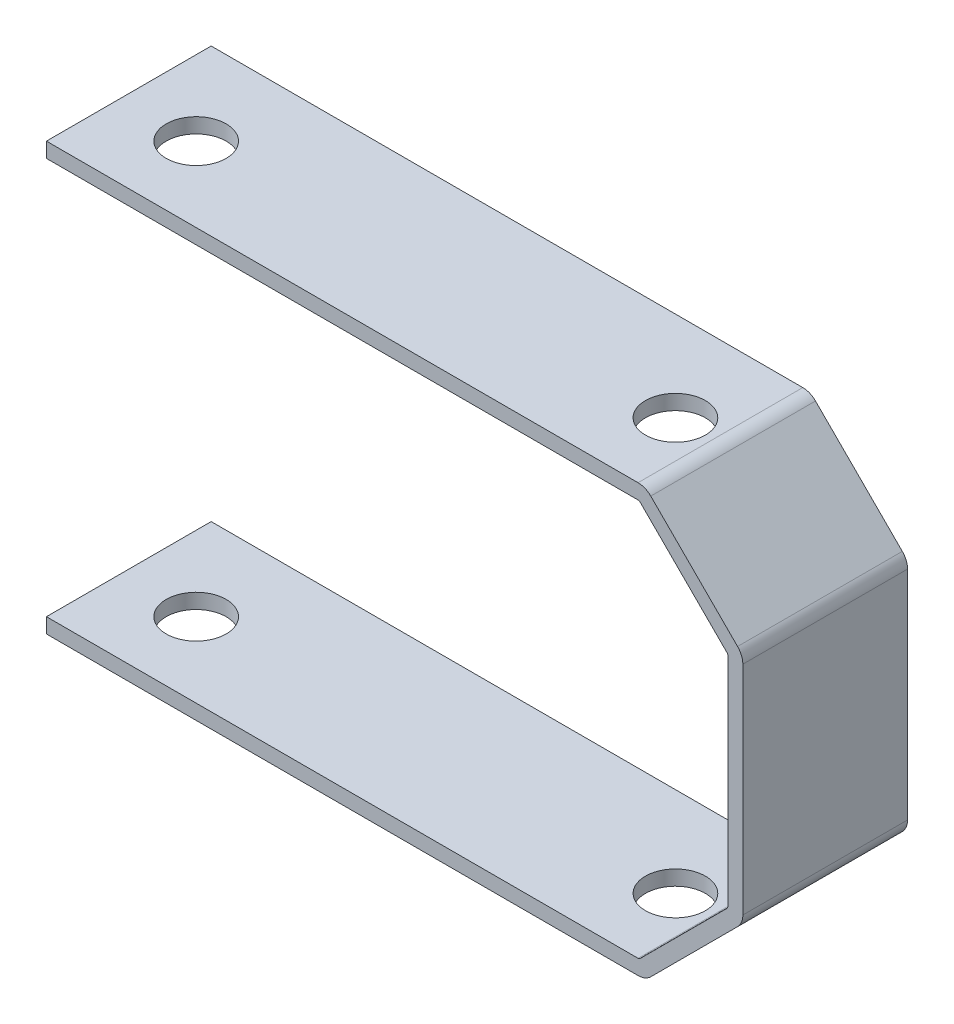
ISO-10303-21;
HEADER;
FILE_DESCRIPTION(('STEP AP214'),'2;1');
FILE_NAME('part.step','',(''),(''),'','','');
FILE_SCHEMA(('AUTOMOTIVE_DESIGN { 1 0 10303 214 1 1 1 1 }'));
ENDSEC;
DATA;
#1=APPLICATION_CONTEXT('core data for automotive mechanical design processes');
#2=APPLICATION_PROTOCOL_DEFINITION('international standard','automotive_design',2000,#1);
#3=PRODUCT_CONTEXT('',#1,'mechanical');
#4=PRODUCT('Part','Part','',(#3));
#5=PRODUCT_RELATED_PRODUCT_CATEGORY('part','',(#4));
#6=PRODUCT_DEFINITION_FORMATION('','',#4);
#7=PRODUCT_DEFINITION_CONTEXT('part definition',#1,'design');
#8=PRODUCT_DEFINITION('design','',#6,#7);
#9=PRODUCT_DEFINITION_SHAPE('','',#8);
#10=(LENGTH_UNIT() NAMED_UNIT(*) SI_UNIT(.MILLI.,.METRE.));
#11=(NAMED_UNIT(*) PLANE_ANGLE_UNIT() SI_UNIT($,.RADIAN.));
#12=(NAMED_UNIT(*) SI_UNIT($,.STERADIAN.) SOLID_ANGLE_UNIT());
#13=UNCERTAINTY_MEASURE_WITH_UNIT(LENGTH_MEASURE(1.E-05),#10,'distance_accuracy_value','');
#14=(GEOMETRIC_REPRESENTATION_CONTEXT(3) GLOBAL_UNCERTAINTY_ASSIGNED_CONTEXT((#13)) GLOBAL_UNIT_ASSIGNED_CONTEXT((#10,
#11,#12)) REPRESENTATION_CONTEXT('',''));
#15=CARTESIAN_POINT('',(0.,0.,0.));
#16=DIRECTION('',(0.,0.,1.));
#17=DIRECTION('',(1.,0.,0.));
#18=AXIS2_PLACEMENT_3D('',#15,#16,#17);
#19=CARTESIAN_POINT('',(875.126946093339,307.774921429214,0.));
#20=DIRECTION('',(0.,0.,1.));
#21=DIRECTION('',(1.,0.,0.));
#22=AXIS2_PLACEMENT_3D('',#19,#20,#21);
#23=CYLINDRICAL_SURFACE('',#22,2.);
#24=DIRECTION('',(0.,0.,1.));
#25=VECTOR('',#24,1.);
#26=CARTESIAN_POINT('',(876.541159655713,309.189134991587,0.));
#27=LINE('',#26,#25);
#28=CARTESIAN_POINT('',(876.541159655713,309.189134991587,0.));
#29=VERTEX_POINT('',#28);
#30=CARTESIAN_POINT('',(876.541159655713,309.189134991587,110.));
#31=VERTEX_POINT('',#30);
#32=EDGE_CURVE('E151',#29,#31,#27,.T.);
#33=ORIENTED_EDGE('',*,*,#32,.F.);
#34=CARTESIAN_POINT('',(875.126946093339,307.774921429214,0.));
#35=DIRECTION('',(0.,0.,1.));
#36=DIRECTION('',(1.,0.,0.));
#37=AXIS2_PLACEMENT_3D('',#34,#35,#36);
#38=CIRCLE('',#37,2.);
#39=CARTESIAN_POINT('',(877.126946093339,307.774921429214,0.));
#40=VERTEX_POINT('',#39);
#41=EDGE_CURVE('E20',#40,#29,#38,.T.);
#42=ORIENTED_EDGE('',*,*,#41,.F.);
#43=DIRECTION('',(0.,0.,1.));
#44=VECTOR('',#43,1.);
#45=CARTESIAN_POINT('',(877.126946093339,307.774921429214,0.));
#46=LINE('',#45,#44);
#47=CARTESIAN_POINT('',(877.126946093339,307.774921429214,110.));
#48=VERTEX_POINT('',#47);
#49=EDGE_CURVE('E155',#48,#40,#46,.F.);
#50=ORIENTED_EDGE('',*,*,#49,.F.);
#51=CARTESIAN_POINT('',(875.126946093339,307.774921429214,110.));
#52=DIRECTION('',(0.,0.,1.));
#53=DIRECTION('',(1.,0.,0.));
#54=AXIS2_PLACEMENT_3D('',#51,#52,#53);
#55=CIRCLE('',#54,2.);
#56=EDGE_CURVE('E149',#31,#48,#55,.F.);
#57=ORIENTED_EDGE('',*,*,#56,.F.);
#58=EDGE_LOOP('',(#33,#42,#50,#57));
#59=FACE_BOUND('',#58,.T.);
#60=ADVANCED_FACE('F16',(#59),#23,.F.);
#61=CARTESIAN_POINT('',(875.126946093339,162.716046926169,0.));
#62=DIRECTION('',(0.,0.,1.));
#63=DIRECTION('',(1.,0.,0.));
#64=AXIS2_PLACEMENT_3D('',#61,#62,#63);
#65=CYLINDRICAL_SURFACE('',#64,2.);
#66=DIRECTION('',(0.,0.,1.));
#67=VECTOR('',#66,1.);
#68=CARTESIAN_POINT('',(877.126946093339,162.716046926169,0.));
#69=LINE('',#68,#67);
#70=CARTESIAN_POINT('',(877.126946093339,162.716046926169,0.));
#71=VERTEX_POINT('',#70);
#72=CARTESIAN_POINT('',(877.126946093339,162.716046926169,110.));
#73=VERTEX_POINT('',#72);
#74=EDGE_CURVE('E255',#71,#73,#69,.T.);
#75=ORIENTED_EDGE('',*,*,#74,.F.);
#76=CARTESIAN_POINT('',(875.126946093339,162.716046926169,0.));
#77=DIRECTION('',(0.,0.,1.));
#78=DIRECTION('',(1.,0.,0.));
#79=AXIS2_PLACEMENT_3D('',#76,#77,#78);
#80=CIRCLE('',#79,2.);
#81=CARTESIAN_POINT('',(876.541159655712,161.301833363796,0.));
#82=VERTEX_POINT('',#81);
#83=EDGE_CURVE('E315',#82,#71,#80,.T.);
#84=ORIENTED_EDGE('',*,*,#83,.F.);
#85=DIRECTION('',(0.,0.,1.));
#86=VECTOR('',#85,1.);
#87=CARTESIAN_POINT('',(876.541159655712,161.301833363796,0.));
#88=LINE('',#87,#86);
#89=CARTESIAN_POINT('',(876.541159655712,161.301833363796,110.));
#90=VERTEX_POINT('',#89);
#91=EDGE_CURVE('E252',#90,#82,#88,.F.);
#92=ORIENTED_EDGE('',*,*,#91,.F.);
#93=CARTESIAN_POINT('',(875.126946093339,162.716046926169,110.));
#94=DIRECTION('',(0.,0.,1.));
#95=DIRECTION('',(1.,0.,0.));
#96=AXIS2_PLACEMENT_3D('',#93,#94,#95);
#97=CIRCLE('',#96,2.);
#98=EDGE_CURVE('E313',#73,#90,#97,.F.);
#99=ORIENTED_EDGE('',*,*,#98,.F.);
#100=EDGE_LOOP('',(#75,#84,#92,#99));
#101=FACE_BOUND('',#100,.T.);
#102=ADVANCED_FACE('F369',(#101),#65,.F.);
#103=CARTESIAN_POINT('',(817.156383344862,365.745484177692,0.));
#104=DIRECTION('',(0.,0.,1.));
#105=DIRECTION('',(1.,0.,0.));
#106=AXIS2_PLACEMENT_3D('',#103,#104,#105);
#107=CYLINDRICAL_SURFACE('',#106,2.);
#108=DIRECTION('',(0.,0.,-1.));
#109=VECTOR('',#108,1.);
#110=CARTESIAN_POINT('',(817.156383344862,367.745484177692,0.));
#111=LINE('',#110,#109);
#112=CARTESIAN_POINT('',(817.156383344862,367.745484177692,0.));
#113=VERTEX_POINT('',#112);
#114=CARTESIAN_POINT('',(817.156383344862,367.745484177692,110.));
#115=VERTEX_POINT('',#114);
#116=EDGE_CURVE('E204',#113,#115,#111,.F.);
#117=ORIENTED_EDGE('',*,*,#116,.F.);
#118=CARTESIAN_POINT('',(817.156383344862,365.745484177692,0.));
#119=DIRECTION('',(0.,0.,1.));
#120=DIRECTION('',(1.,0.,0.));
#121=AXIS2_PLACEMENT_3D('',#118,#119,#120);
#122=CIRCLE('',#121,2.);
#123=CARTESIAN_POINT('',(818.570596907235,367.159697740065,0.));
#124=VERTEX_POINT('',#123);
#125=EDGE_CURVE('E311',#124,#113,#122,.T.);
#126=ORIENTED_EDGE('',*,*,#125,.F.);
#127=DIRECTION('',(0.,0.,1.));
#128=VECTOR('',#127,1.);
#129=CARTESIAN_POINT('',(818.570596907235,367.159697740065,0.));
#130=LINE('',#129,#128);
#131=CARTESIAN_POINT('',(818.570596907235,367.159697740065,110.));
#132=VERTEX_POINT('',#131);
#133=EDGE_CURVE('E156',#132,#124,#130,.F.);
#134=ORIENTED_EDGE('',*,*,#133,.F.);
#135=CARTESIAN_POINT('',(817.156383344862,365.745484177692,110.));
#136=DIRECTION('',(0.,0.,1.));
#137=DIRECTION('',(1.,0.,0.));
#138=AXIS2_PLACEMENT_3D('',#135,#136,#137);
#139=CIRCLE('',#138,2.);
#140=EDGE_CURVE('E309',#115,#132,#139,.F.);
#141=ORIENTED_EDGE('',*,*,#140,.F.);
#142=EDGE_LOOP('',(#117,#126,#134,#141));
#143=FACE_BOUND('',#142,.T.);
#144=ADVANCED_FACE('F371',(#143),#107,.F.);
#145=CARTESIAN_POINT('',(472.12694609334,367.745484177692,60.));
#146=DIRECTION('',(0.,1.,0.));
#147=DIRECTION('',(0.,0.,1.));
#148=AXIS2_PLACEMENT_3D('',#145,#146,#147);
#149=CYLINDRICAL_SURFACE('',#148,20.);
#150=CARTESIAN_POINT('',(472.12694609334,377.745484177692,60.));
#151=DIRECTION('',(0.,1.,0.));
#152=DIRECTION('',(0.,0.,1.));
#153=AXIS2_PLACEMENT_3D('',#150,#151,#152);
#154=CIRCLE('',#153,20.);
#155=CARTESIAN_POINT('',(472.12694609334,377.745484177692,80.));
#156=VERTEX_POINT('',#155);
#157=EDGE_CURVE('E229',#156,#156,#154,.F.);
#158=ORIENTED_EDGE('',*,*,#157,.F.);
#159=EDGE_LOOP('',(#158));
#160=FACE_BOUND('',#159,.T.);
#161=CARTESIAN_POINT('',(472.12694609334,367.745484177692,60.));
#162=DIRECTION('',(0.,1.,0.));
#163=DIRECTION('',(0.,0.,1.));
#164=AXIS2_PLACEMENT_3D('',#161,#162,#163);
#165=CIRCLE('',#164,20.);
#166=CARTESIAN_POINT('',(472.12694609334,367.745484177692,80.));
#167=VERTEX_POINT('',#166);
#168=EDGE_CURVE('E207',#167,#167,#165,.T.);
#169=ORIENTED_EDGE('',*,*,#168,.F.);
#170=EDGE_LOOP('',(#169));
#171=FACE_BOUND('',#170,.T.);
#172=ADVANCED_FACE('F376',(#160,#171),#149,.F.);
#173=CARTESIAN_POINT('',(792.12694609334,367.745484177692,60.0000000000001));
#174=DIRECTION('',(0.,1.,0.));
#175=DIRECTION('',(0.,0.,1.));
#176=AXIS2_PLACEMENT_3D('',#173,#174,#175);
#177=CYLINDRICAL_SURFACE('',#176,20.);
#178=CARTESIAN_POINT('',(792.12694609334,377.745484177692,60.0000000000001));
#179=DIRECTION('',(0.,1.,0.));
#180=DIRECTION('',(0.,0.,1.));
#181=AXIS2_PLACEMENT_3D('',#178,#179,#180);
#182=CIRCLE('',#181,20.);
#183=CARTESIAN_POINT('',(792.12694609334,377.745484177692,80.0000000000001));
#184=VERTEX_POINT('',#183);
#185=EDGE_CURVE('E223',#184,#184,#182,.F.);
#186=ORIENTED_EDGE('',*,*,#185,.F.);
#187=EDGE_LOOP('',(#186));
#188=FACE_BOUND('',#187,.T.);
#189=CARTESIAN_POINT('',(792.12694609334,367.745484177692,60.0000000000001));
#190=DIRECTION('',(0.,1.,0.));
#191=DIRECTION('',(0.,0.,1.));
#192=AXIS2_PLACEMENT_3D('',#189,#190,#191);
#193=CIRCLE('',#192,20.);
#194=CARTESIAN_POINT('',(792.12694609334,367.745484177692,80.0000000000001));
#195=VERTEX_POINT('',#194);
#196=EDGE_CURVE('E245',#195,#195,#193,.T.);
#197=ORIENTED_EDGE('',*,*,#196,.F.);
#198=EDGE_LOOP('',(#197));
#199=FACE_BOUND('',#198,.T.);
#200=ADVANCED_FACE('F396',(#188,#199),#177,.F.);
#201=CARTESIAN_POINT('',(817.156383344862,104.745484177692,0.));
#202=DIRECTION('',(0.,0.,1.));
#203=DIRECTION('',(1.,0.,0.));
#204=AXIS2_PLACEMENT_3D('',#201,#202,#203);
#205=CYLINDRICAL_SURFACE('',#204,2.);
#206=DIRECTION('',(0.,0.,1.));
#207=VECTOR('',#206,1.);
#208=CARTESIAN_POINT('',(818.570596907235,103.331270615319,0.));
#209=LINE('',#208,#207);
#210=CARTESIAN_POINT('',(818.570596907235,103.331270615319,0.));
#211=VERTEX_POINT('',#210);
#212=CARTESIAN_POINT('',(818.570596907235,103.331270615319,110.));
#213=VERTEX_POINT('',#212);
#214=EDGE_CURVE('E242',#211,#213,#209,.T.);
#215=ORIENTED_EDGE('',*,*,#214,.F.);
#216=CARTESIAN_POINT('',(817.156383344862,104.745484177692,0.));
#217=DIRECTION('',(0.,0.,1.));
#218=DIRECTION('',(1.,0.,0.));
#219=AXIS2_PLACEMENT_3D('',#216,#217,#218);
#220=CIRCLE('',#219,2.);
#221=CARTESIAN_POINT('',(817.156383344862,102.745484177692,0.));
#222=VERTEX_POINT('',#221);
#223=EDGE_CURVE('E307',#222,#211,#220,.T.);
#224=ORIENTED_EDGE('',*,*,#223,.F.);
#225=DIRECTION('',(0.,0.,1.));
#226=VECTOR('',#225,1.);
#227=CARTESIAN_POINT('',(817.156383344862,102.745484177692,0.));
#228=LINE('',#227,#226);
#229=CARTESIAN_POINT('',(817.156383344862,102.745484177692,110.));
#230=VERTEX_POINT('',#229);
#231=EDGE_CURVE('E244',#230,#222,#228,.F.);
#232=ORIENTED_EDGE('',*,*,#231,.F.);
#233=CARTESIAN_POINT('',(817.156383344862,104.745484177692,110.));
#234=DIRECTION('',(0.,0.,1.));
#235=DIRECTION('',(1.,0.,0.));
#236=AXIS2_PLACEMENT_3D('',#233,#234,#235);
#237=CIRCLE('',#236,2.);
#238=EDGE_CURVE('E261',#213,#230,#237,.F.);
#239=ORIENTED_EDGE('',*,*,#238,.F.);
#240=EDGE_LOOP('',(#215,#224,#232,#239));
#241=FACE_BOUND('',#240,.T.);
#242=ADVANCED_FACE('F363',(#241),#205,.F.);
#243=CARTESIAN_POINT('',(876.541159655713,309.189134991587,0.));
#244=DIRECTION('',(-0.707106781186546,-0.707106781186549,0.));
#245=DIRECTION('',(0.707106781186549,-0.707106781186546,0.));
#246=AXIS2_PLACEMENT_3D('',#243,#244,#245);
#247=PLANE('',#246);
#248=DIRECTION('',(0.707106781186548,-0.707106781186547,0.));
#249=VECTOR('',#248,1.);
#250=CARTESIAN_POINT('',(818.570596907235,367.159697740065,0.));
#251=LINE('',#250,#249);
#252=EDGE_CURVE('E146',#124,#29,#251,.T.);
#253=ORIENTED_EDGE('',*,*,#252,.T.);
#254=ORIENTED_EDGE('',*,*,#32,.T.);
#255=DIRECTION('',(0.707106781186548,-0.707106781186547,0.));
#256=VECTOR('',#255,1.);
#257=CARTESIAN_POINT('',(818.570596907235,367.159697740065,110.));
#258=LINE('',#257,#256);
#259=EDGE_CURVE('E321',#132,#31,#258,.T.);
#260=ORIENTED_EDGE('',*,*,#259,.F.);
#261=ORIENTED_EDGE('',*,*,#133,.T.);
#262=EDGE_LOOP('',(#253,#254,#260,#261));
#263=FACE_BOUND('',#262,.T.);
#264=ADVANCED_FACE('F159',(#263),#247,.T.);
#265=CARTESIAN_POINT('',(877.126946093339,162.716046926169,0.));
#266=DIRECTION('',(-1.,0.,0.));
#267=DIRECTION('',(0.,0.,1.));
#268=AXIS2_PLACEMENT_3D('',#265,#266,#267);
#269=PLANE('',#268);
#270=DIRECTION('',(0.,1.,0.));
#271=VECTOR('',#270,1.);
#272=CARTESIAN_POINT('',(877.126946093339,235.245484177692,0.));
#273=LINE('',#272,#271);
#274=EDGE_CURVE('E148',#40,#71,#273,.F.);
#275=ORIENTED_EDGE('',*,*,#274,.T.);
#276=ORIENTED_EDGE('',*,*,#74,.T.);
#277=DIRECTION('',(0.,1.,0.));
#278=VECTOR('',#277,1.);
#279=CARTESIAN_POINT('',(877.126946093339,235.245484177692,110.));
#280=LINE('',#279,#278);
#281=EDGE_CURVE('E320',#48,#73,#280,.F.);
#282=ORIENTED_EDGE('',*,*,#281,.F.);
#283=ORIENTED_EDGE('',*,*,#49,.T.);
#284=EDGE_LOOP('',(#275,#276,#282,#283));
#285=FACE_BOUND('',#284,.T.);
#286=ADVANCED_FACE('F323',(#285),#269,.T.);
#287=CARTESIAN_POINT('',(818.570596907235,103.331270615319,0.));
#288=DIRECTION('',(-0.707106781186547,0.707106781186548,0.));
#289=DIRECTION('',(-0.707106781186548,-0.707106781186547,0.));
#290=AXIS2_PLACEMENT_3D('',#287,#288,#289);
#291=PLANE('',#290);
#292=DIRECTION('',(-0.707106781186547,-0.707106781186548,0.));
#293=VECTOR('',#292,1.);
#294=CARTESIAN_POINT('',(876.541159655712,161.301833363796,0.));
#295=LINE('',#294,#293);
#296=EDGE_CURVE('E163',#82,#211,#295,.T.);
#297=ORIENTED_EDGE('',*,*,#296,.T.);
#298=ORIENTED_EDGE('',*,*,#214,.T.);
#299=DIRECTION('',(-0.707106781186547,-0.707106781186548,0.));
#300=VECTOR('',#299,1.);
#301=CARTESIAN_POINT('',(876.541159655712,161.301833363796,110.));
#302=LINE('',#301,#300);
#303=EDGE_CURVE('E325',#90,#213,#302,.T.);
#304=ORIENTED_EDGE('',*,*,#303,.F.);
#305=ORIENTED_EDGE('',*,*,#91,.T.);
#306=EDGE_LOOP('',(#297,#298,#304,#305));
#307=FACE_BOUND('',#306,.T.);
#308=ADVANCED_FACE('F355',(#307),#291,.T.);
#309=CARTESIAN_POINT('',(875.126946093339,162.716046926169,0.));
#310=DIRECTION('',(0.,0.,1.));
#311=DIRECTION('',(1.,0.,0.));
#312=AXIS2_PLACEMENT_3D('',#309,#310,#311);
#313=CYLINDRICAL_SURFACE('',#312,12.);
#314=CARTESIAN_POINT('',(875.126946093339,162.716046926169,0.));
#315=DIRECTION('',(0.,0.,1.));
#316=DIRECTION('',(1.,0.,0.));
#317=AXIS2_PLACEMENT_3D('',#314,#315,#316);
#318=CIRCLE('',#317,12.);
#319=CARTESIAN_POINT('',(883.612227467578,154.23076555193,0.));
#320=VERTEX_POINT('',#319);
#321=CARTESIAN_POINT('',(887.126946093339,162.716046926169,0.));
#322=VERTEX_POINT('',#321);
#323=EDGE_CURVE('E284',#320,#322,#318,.T.);
#324=ORIENTED_EDGE('',*,*,#323,.T.);
#325=DIRECTION('',(0.,0.,-1.));
#326=VECTOR('',#325,1.);
#327=CARTESIAN_POINT('',(887.126946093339,162.716046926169,0.));
#328=LINE('',#327,#326);
#329=CARTESIAN_POINT('',(887.126946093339,162.716046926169,110.));
#330=VERTEX_POINT('',#329);
#331=EDGE_CURVE('E239',#330,#322,#328,.T.);
#332=ORIENTED_EDGE('',*,*,#331,.F.);
#333=CARTESIAN_POINT('',(875.126946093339,162.716046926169,110.));
#334=DIRECTION('',(0.,0.,1.));
#335=DIRECTION('',(1.,0.,0.));
#336=AXIS2_PLACEMENT_3D('',#333,#334,#335);
#337=CIRCLE('',#336,12.);
#338=CARTESIAN_POINT('',(883.612227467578,154.23076555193,110.));
#339=VERTEX_POINT('',#338);
#340=EDGE_CURVE('E294',#339,#330,#337,.T.);
#341=ORIENTED_EDGE('',*,*,#340,.F.);
#342=DIRECTION('',(0.,0.,1.));
#343=VECTOR('',#342,1.);
#344=CARTESIAN_POINT('',(883.612227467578,154.23076555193,0.));
#345=LINE('',#344,#343);
#346=EDGE_CURVE('E243',#320,#339,#345,.T.);
#347=ORIENTED_EDGE('',*,*,#346,.F.);
#348=EDGE_LOOP('',(#324,#332,#341,#347));
#349=FACE_BOUND('',#348,.T.);
#350=ADVANCED_FACE('F458',(#349),#313,.T.);
#351=CARTESIAN_POINT('',(887.126946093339,307.774921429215,0.));
#352=DIRECTION('',(1.,0.,0.));
#353=DIRECTION('',(0.,0.,-1.));
#354=AXIS2_PLACEMENT_3D('',#351,#352,#353);
#355=PLANE('',#354);
#356=DIRECTION('',(0.,1.,0.));
#357=VECTOR('',#356,1.);
#358=CARTESIAN_POINT('',(887.126946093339,235.245484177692,0.));
#359=LINE('',#358,#357);
#360=CARTESIAN_POINT('',(887.126946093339,307.774921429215,0.));
#361=VERTEX_POINT('',#360);
#362=EDGE_CURVE('E283',#322,#361,#359,.T.);
#363=ORIENTED_EDGE('',*,*,#362,.T.);
#364=DIRECTION('',(0.,0.,1.));
#365=VECTOR('',#364,1.);
#366=CARTESIAN_POINT('',(887.126946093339,307.774921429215,0.));
#367=LINE('',#366,#365);
#368=CARTESIAN_POINT('',(887.126946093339,307.774921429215,110.));
#369=VERTEX_POINT('',#368);
#370=EDGE_CURVE('E236',#369,#361,#367,.F.);
#371=ORIENTED_EDGE('',*,*,#370,.F.);
#372=DIRECTION('',(0.,1.,0.));
#373=VECTOR('',#372,1.);
#374=CARTESIAN_POINT('',(887.126946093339,235.245484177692,110.));
#375=LINE('',#374,#373);
#376=EDGE_CURVE('E293',#330,#369,#375,.T.);
#377=ORIENTED_EDGE('',*,*,#376,.F.);
#378=ORIENTED_EDGE('',*,*,#331,.T.);
#379=EDGE_LOOP('',(#363,#371,#377,#378));
#380=FACE_BOUND('',#379,.T.);
#381=ADVANCED_FACE('F462',(#380),#355,.T.);
#382=CARTESIAN_POINT('',(875.126946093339,307.774921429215,0.));
#383=DIRECTION('',(0.,0.,1.));
#384=DIRECTION('',(1.,0.,0.));
#385=AXIS2_PLACEMENT_3D('',#382,#383,#384);
#386=CYLINDRICAL_SURFACE('',#385,12.);
#387=CARTESIAN_POINT('',(875.126946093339,307.774921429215,0.));
#388=DIRECTION('',(0.,0.,1.));
#389=DIRECTION('',(1.,0.,0.));
#390=AXIS2_PLACEMENT_3D('',#387,#388,#389);
#391=CIRCLE('',#390,12.);
#392=CARTESIAN_POINT('',(883.612227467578,316.260202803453,0.));
#393=VERTEX_POINT('',#392);
#394=EDGE_CURVE('E281',#361,#393,#391,.T.);
#395=ORIENTED_EDGE('',*,*,#394,.T.);
#396=DIRECTION('',(0.,0.,1.));
#397=VECTOR('',#396,1.);
#398=CARTESIAN_POINT('',(883.612227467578,316.260202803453,0.));
#399=LINE('',#398,#397);
#400=CARTESIAN_POINT('',(883.612227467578,316.260202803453,110.));
#401=VERTEX_POINT('',#400);
#402=EDGE_CURVE('E233',#401,#393,#399,.F.);
#403=ORIENTED_EDGE('',*,*,#402,.F.);
#404=CARTESIAN_POINT('',(875.126946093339,307.774921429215,110.));
#405=DIRECTION('',(0.,0.,1.));
#406=DIRECTION('',(1.,0.,0.));
#407=AXIS2_PLACEMENT_3D('',#404,#405,#406);
#408=CIRCLE('',#407,12.);
#409=EDGE_CURVE('E290',#369,#401,#408,.T.);
#410=ORIENTED_EDGE('',*,*,#409,.F.);
#411=ORIENTED_EDGE('',*,*,#370,.T.);
#412=EDGE_LOOP('',(#395,#403,#410,#411));
#413=FACE_BOUND('',#412,.T.);
#414=ADVANCED_FACE('F466',(#413),#386,.T.);
#415=CARTESIAN_POINT('',(825.641664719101,374.23076555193,0.));
#416=DIRECTION('',(0.707106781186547,0.707106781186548,0.));
#417=DIRECTION('',(-0.707106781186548,0.707106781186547,0.));
#418=AXIS2_PLACEMENT_3D('',#415,#416,#417);
#419=PLANE('',#418);
#420=DIRECTION('',(-0.707106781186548,0.707106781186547,0.));
#421=VECTOR('',#420,1.);
#422=CARTESIAN_POINT('',(883.612227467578,316.260202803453,0.));
#423=LINE('',#422,#421);
#424=CARTESIAN_POINT('',(825.641664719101,374.23076555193,0.));
#425=VERTEX_POINT('',#424);
#426=EDGE_CURVE('E280',#393,#425,#423,.T.);
#427=ORIENTED_EDGE('',*,*,#426,.T.);
#428=DIRECTION('',(0.,0.,1.));
#429=VECTOR('',#428,1.);
#430=CARTESIAN_POINT('',(825.641664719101,374.23076555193,0.));
#431=LINE('',#430,#429);
#432=CARTESIAN_POINT('',(825.641664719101,374.23076555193,110.));
#433=VERTEX_POINT('',#432);
#434=EDGE_CURVE('E230',#433,#425,#431,.F.);
#435=ORIENTED_EDGE('',*,*,#434,.F.);
#436=DIRECTION('',(-0.707106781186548,0.707106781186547,0.));
#437=VECTOR('',#436,1.);
#438=CARTESIAN_POINT('',(883.612227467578,316.260202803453,110.));
#439=LINE('',#438,#437);
#440=EDGE_CURVE('E289',#401,#433,#439,.T.);
#441=ORIENTED_EDGE('',*,*,#440,.F.);
#442=ORIENTED_EDGE('',*,*,#402,.T.);
#443=EDGE_LOOP('',(#427,#435,#441,#442));
#444=FACE_BOUND('',#443,.T.);
#445=ADVANCED_FACE('F470',(#444),#419,.T.);
#446=CARTESIAN_POINT('',(817.156383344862,365.745484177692,0.));
#447=DIRECTION('',(0.,0.,1.));
#448=DIRECTION('',(1.,0.,0.));
#449=AXIS2_PLACEMENT_3D('',#446,#447,#448);
#450=CYLINDRICAL_SURFACE('',#449,12.);
#451=CARTESIAN_POINT('',(817.156383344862,365.745484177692,0.));
#452=DIRECTION('',(0.,0.,1.));
#453=DIRECTION('',(1.,0.,0.));
#454=AXIS2_PLACEMENT_3D('',#451,#452,#453);
#455=CIRCLE('',#454,12.);
#456=CARTESIAN_POINT('',(817.156383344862,377.745484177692,0.));
#457=VERTEX_POINT('',#456);
#458=EDGE_CURVE('E278',#425,#457,#455,.T.);
#459=ORIENTED_EDGE('',*,*,#458,.T.);
#460=DIRECTION('',(0.,0.,1.));
#461=VECTOR('',#460,1.);
#462=CARTESIAN_POINT('',(817.156383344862,377.745484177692,0.));
#463=LINE('',#462,#461);
#464=CARTESIAN_POINT('',(817.156383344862,377.745484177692,110.));
#465=VERTEX_POINT('',#464);
#466=EDGE_CURVE('E226',#465,#457,#463,.F.);
#467=ORIENTED_EDGE('',*,*,#466,.F.);
#468=CARTESIAN_POINT('',(817.156383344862,365.745484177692,110.));
#469=DIRECTION('',(0.,0.,1.));
#470=DIRECTION('',(1.,0.,0.));
#471=AXIS2_PLACEMENT_3D('',#468,#469,#470);
#472=CIRCLE('',#471,12.);
#473=EDGE_CURVE('E286',#433,#465,#472,.T.);
#474=ORIENTED_EDGE('',*,*,#473,.F.);
#475=ORIENTED_EDGE('',*,*,#434,.T.);
#476=EDGE_LOOP('',(#459,#467,#474,#475));
#477=FACE_BOUND('',#476,.T.);
#478=ADVANCED_FACE('F472',(#477),#450,.T.);
#479=CARTESIAN_POINT('',(422.126946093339,377.745484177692,0.));
#480=DIRECTION('',(0.,1.,0.));
#481=DIRECTION('',(0.,0.,1.));
#482=AXIS2_PLACEMENT_3D('',#479,#480,#481);
#483=PLANE('',#482);
#484=ORIENTED_EDGE('',*,*,#185,.T.);
#485=EDGE_LOOP('',(#484));
#486=FACE_BOUND('',#485,.T.);
#487=ORIENTED_EDGE('',*,*,#157,.T.);
#488=EDGE_LOOP('',(#487));
#489=FACE_BOUND('',#488,.T.);
#490=DIRECTION('',(1.,0.,0.));
#491=VECTOR('',#490,1.);
#492=CARTESIAN_POINT('',(689.644730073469,377.745484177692,0.));
#493=LINE('',#492,#491);
#494=CARTESIAN_POINT('',(422.126946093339,377.745484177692,0.));
#495=VERTEX_POINT('',#494);
#496=EDGE_CURVE('E218',#457,#495,#493,.F.);
#497=ORIENTED_EDGE('',*,*,#496,.T.);
#498=DIRECTION('',(0.,0.,1.));
#499=VECTOR('',#498,1.);
#500=CARTESIAN_POINT('',(422.126946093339,377.745484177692,0.));
#501=LINE('',#500,#499);
#502=CARTESIAN_POINT('',(422.126946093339,377.745484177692,110.));
#503=VERTEX_POINT('',#502);
#504=EDGE_CURVE('E211',#503,#495,#501,.F.);
#505=ORIENTED_EDGE('',*,*,#504,.F.);
#506=DIRECTION('',(1.,0.,0.));
#507=VECTOR('',#506,1.);
#508=CARTESIAN_POINT('',(689.644730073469,377.745484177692,110.));
#509=LINE('',#508,#507);
#510=EDGE_CURVE('E192',#465,#503,#509,.F.);
#511=ORIENTED_EDGE('',*,*,#510,.F.);
#512=ORIENTED_EDGE('',*,*,#466,.T.);
#513=EDGE_LOOP('',(#497,#505,#511,#512));
#514=FACE_BOUND('',#513,.T.);
#515=ADVANCED_FACE('F428',(#486,#489,#514),#483,.T.);
#516=CARTESIAN_POINT('',(422.126946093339,367.745484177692,0.));
#517=DIRECTION('',(-1.,0.,0.));
#518=DIRECTION('',(0.,0.,1.));
#519=AXIS2_PLACEMENT_3D('',#516,#517,#518);
#520=PLANE('',#519);
#521=DIRECTION('',(0.,1.,0.));
#522=VECTOR('',#521,1.);
#523=CARTESIAN_POINT('',(422.126946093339,235.245484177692,0.));
#524=LINE('',#523,#522);
#525=CARTESIAN_POINT('',(422.126946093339,367.745484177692,0.));
#526=VERTEX_POINT('',#525);
#527=EDGE_CURVE('E214',#495,#526,#524,.F.);
#528=ORIENTED_EDGE('',*,*,#527,.T.);
#529=DIRECTION('',(0.,0.,-1.));
#530=VECTOR('',#529,1.);
#531=CARTESIAN_POINT('',(422.126946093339,367.745484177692,0.));
#532=LINE('',#531,#530);
#533=CARTESIAN_POINT('',(422.126946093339,367.745484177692,110.));
#534=VERTEX_POINT('',#533);
#535=EDGE_CURVE('E208',#534,#526,#532,.T.);
#536=ORIENTED_EDGE('',*,*,#535,.F.);
#537=DIRECTION('',(0.,1.,0.));
#538=VECTOR('',#537,1.);
#539=CARTESIAN_POINT('',(422.126946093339,235.245484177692,110.));
#540=LINE('',#539,#538);
#541=EDGE_CURVE('E251',#503,#534,#540,.F.);
#542=ORIENTED_EDGE('',*,*,#541,.F.);
#543=ORIENTED_EDGE('',*,*,#504,.T.);
#544=EDGE_LOOP('',(#528,#536,#542,#543));
#545=FACE_BOUND('',#544,.T.);
#546=ADVANCED_FACE('F433',(#545),#520,.T.);
#547=CARTESIAN_POINT('',(817.156383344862,367.745484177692,0.));
#548=DIRECTION('',(0.,-1.,0.));
#549=DIRECTION('',(0.,0.,-1.));
#550=AXIS2_PLACEMENT_3D('',#547,#548,#549);
#551=PLANE('',#550);
#552=ORIENTED_EDGE('',*,*,#196,.T.);
#553=EDGE_LOOP('',(#552));
#554=FACE_BOUND('',#553,.T.);
#555=ORIENTED_EDGE('',*,*,#168,.T.);
#556=EDGE_LOOP('',(#555));
#557=FACE_BOUND('',#556,.T.);
#558=DIRECTION('',(1.,0.,0.));
#559=VECTOR('',#558,1.);
#560=CARTESIAN_POINT('',(689.644730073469,367.745484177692,0.));
#561=LINE('',#560,#559);
#562=EDGE_CURVE('E217',#526,#113,#561,.T.);
#563=ORIENTED_EDGE('',*,*,#562,.T.);
#564=ORIENTED_EDGE('',*,*,#116,.T.);
#565=DIRECTION('',(1.,0.,0.));
#566=VECTOR('',#565,1.);
#567=CARTESIAN_POINT('',(689.644730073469,367.745484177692,110.));
#568=LINE('',#567,#566);
#569=EDGE_CURVE('E265',#534,#115,#568,.T.);
#570=ORIENTED_EDGE('',*,*,#569,.F.);
#571=ORIENTED_EDGE('',*,*,#535,.T.);
#572=EDGE_LOOP('',(#563,#564,#570,#571));
#573=FACE_BOUND('',#572,.T.);
#574=ADVANCED_FACE('F438',(#554,#557,#573),#551,.T.);
#575=CARTESIAN_POINT('',(883.612227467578,154.23076555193,0.));
#576=DIRECTION('',(0.707106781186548,-0.707106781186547,0.));
#577=DIRECTION('',(0.707106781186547,0.707106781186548,0.));
#578=AXIS2_PLACEMENT_3D('',#575,#576,#577);
#579=PLANE('',#578);
#580=DIRECTION('',(0.707106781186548,0.707106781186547,0.));
#581=VECTOR('',#580,1.);
#582=CARTESIAN_POINT('',(825.641664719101,96.2602028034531,0.));
#583=LINE('',#582,#581);
#584=CARTESIAN_POINT('',(825.641664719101,96.2602028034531,0.));
#585=VERTEX_POINT('',#584);
#586=EDGE_CURVE('E181',#585,#320,#583,.T.);
#587=ORIENTED_EDGE('',*,*,#586,.T.);
#588=ORIENTED_EDGE('',*,*,#346,.T.);
#589=DIRECTION('',(0.707106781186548,0.707106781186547,0.));
#590=VECTOR('',#589,1.);
#591=CARTESIAN_POINT('',(825.641664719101,96.2602028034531,110.));
#592=LINE('',#591,#590);
#593=CARTESIAN_POINT('',(825.641664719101,96.2602028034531,110.));
#594=VERTEX_POINT('',#593);
#595=EDGE_CURVE('E297',#594,#339,#592,.T.);
#596=ORIENTED_EDGE('',*,*,#595,.F.);
#597=DIRECTION('',(0.,0.,1.));
#598=VECTOR('',#597,1.);
#599=CARTESIAN_POINT('',(825.641664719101,96.2602028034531,0.));
#600=LINE('',#599,#598);
#601=EDGE_CURVE('E200',#585,#594,#600,.T.);
#602=ORIENTED_EDGE('',*,*,#601,.F.);
#603=EDGE_LOOP('',(#587,#588,#596,#602));
#604=FACE_BOUND('',#603,.T.);
#605=ADVANCED_FACE('F412',(#604),#579,.T.);
#606=CARTESIAN_POINT('',(422.12694609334,102.745484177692,0.));
#607=DIRECTION('',(0.,1.,0.));
#608=DIRECTION('',(0.,0.,1.));
#609=AXIS2_PLACEMENT_3D('',#606,#607,#608);
#610=PLANE('',#609);
#611=CARTESIAN_POINT('',(792.12694609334,102.745484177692,60.0000000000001));
#612=DIRECTION('',(0.,1.,0.));
#613=DIRECTION('',(0.,0.,1.));
#614=AXIS2_PLACEMENT_3D('',#611,#612,#613);
#615=CIRCLE('',#614,20.);
#616=CARTESIAN_POINT('',(792.12694609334,102.745484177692,80.0000000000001));
#617=VERTEX_POINT('',#616);
#618=EDGE_CURVE('E197',#617,#617,#615,.F.);
#619=ORIENTED_EDGE('',*,*,#618,.T.);
#620=EDGE_LOOP('',(#619));
#621=FACE_BOUND('',#620,.T.);
#622=CARTESIAN_POINT('',(472.12694609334,102.745484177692,59.9999999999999));
#623=DIRECTION('',(0.,1.,0.));
#624=DIRECTION('',(0.,0.,1.));
#625=AXIS2_PLACEMENT_3D('',#622,#623,#624);
#626=CIRCLE('',#625,20.);
#627=CARTESIAN_POINT('',(472.12694609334,102.745484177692,79.9999999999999));
#628=VERTEX_POINT('',#627);
#629=EDGE_CURVE('E203',#628,#628,#626,.F.);
#630=ORIENTED_EDGE('',*,*,#629,.T.);
#631=EDGE_LOOP('',(#630));
#632=FACE_BOUND('',#631,.T.);
#633=DIRECTION('',(1.,0.,0.));
#634=VECTOR('',#633,1.);
#635=CARTESIAN_POINT('',(689.644730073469,102.745484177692,0.));
#636=LINE('',#635,#634);
#637=CARTESIAN_POINT('',(422.12694609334,102.745484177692,0.));
#638=VERTEX_POINT('',#637);
#639=EDGE_CURVE('E182',#222,#638,#636,.F.);
#640=ORIENTED_EDGE('',*,*,#639,.T.);
#641=DIRECTION('',(0.,0.,1.));
#642=VECTOR('',#641,1.);
#643=CARTESIAN_POINT('',(422.12694609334,102.745484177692,0.));
#644=LINE('',#643,#642);
#645=CARTESIAN_POINT('',(422.12694609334,102.745484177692,110.));
#646=VERTEX_POINT('',#645);
#647=EDGE_CURVE('E161',#646,#638,#644,.F.);
#648=ORIENTED_EDGE('',*,*,#647,.F.);
#649=DIRECTION('',(1.,0.,0.));
#650=VECTOR('',#649,1.);
#651=CARTESIAN_POINT('',(689.644730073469,102.745484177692,110.));
#652=LINE('',#651,#650);
#653=EDGE_CURVE('E328',#230,#646,#652,.F.);
#654=ORIENTED_EDGE('',*,*,#653,.F.);
#655=ORIENTED_EDGE('',*,*,#231,.T.);
#656=EDGE_LOOP('',(#640,#648,#654,#655));
#657=FACE_BOUND('',#656,.T.);
#658=ADVANCED_FACE('F409',(#621,#632,#657),#610,.T.);
#659=CARTESIAN_POINT('',(689.644730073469,235.245484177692,110.));
#660=DIRECTION('',(0.,0.,1.));
#661=DIRECTION('',(1.,0.,0.));
#662=AXIS2_PLACEMENT_3D('',#659,#660,#661);
#663=PLANE('',#662);
#664=ORIENTED_EDGE('',*,*,#473,.T.);
#665=ORIENTED_EDGE('',*,*,#510,.T.);
#666=ORIENTED_EDGE('',*,*,#541,.T.);
#667=ORIENTED_EDGE('',*,*,#569,.T.);
#668=ORIENTED_EDGE('',*,*,#140,.T.);
#669=ORIENTED_EDGE('',*,*,#259,.T.);
#670=ORIENTED_EDGE('',*,*,#56,.T.);
#671=ORIENTED_EDGE('',*,*,#281,.T.);
#672=ORIENTED_EDGE('',*,*,#98,.T.);
#673=ORIENTED_EDGE('',*,*,#303,.T.);
#674=ORIENTED_EDGE('',*,*,#238,.T.);
#675=ORIENTED_EDGE('',*,*,#653,.T.);
#676=DIRECTION('',(0.,1.,0.));
#677=VECTOR('',#676,1.);
#678=CARTESIAN_POINT('',(422.12694609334,92.7454841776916,110.));
#679=LINE('',#678,#677);
#680=CARTESIAN_POINT('',(422.12694609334,92.7454841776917,110.));
#681=VERTEX_POINT('',#680);
#682=EDGE_CURVE('E166',#681,#646,#679,.T.);
#683=ORIENTED_EDGE('',*,*,#682,.F.);
#684=DIRECTION('',(1.,0.,0.));
#685=VECTOR('',#684,1.);
#686=CARTESIAN_POINT('',(817.156383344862,92.7454841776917,110.));
#687=LINE('',#686,#685);
#688=CARTESIAN_POINT('',(817.156383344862,92.7454841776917,110.));
#689=VERTEX_POINT('',#688);
#690=EDGE_CURVE('E187',#689,#681,#687,.F.);
#691=ORIENTED_EDGE('',*,*,#690,.F.);
#692=CARTESIAN_POINT('',(817.156383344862,104.745484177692,110.));
#693=DIRECTION('',(0.,0.,1.));
#694=DIRECTION('',(1.,0.,0.));
#695=AXIS2_PLACEMENT_3D('',#692,#693,#694);
#696=CIRCLE('',#695,12.);
#697=EDGE_CURVE('E275',#594,#689,#696,.F.);
#698=ORIENTED_EDGE('',*,*,#697,.F.);
#699=ORIENTED_EDGE('',*,*,#595,.T.);
#700=ORIENTED_EDGE('',*,*,#340,.T.);
#701=ORIENTED_EDGE('',*,*,#376,.T.);
#702=ORIENTED_EDGE('',*,*,#409,.T.);
#703=ORIENTED_EDGE('',*,*,#440,.T.);
#704=EDGE_LOOP('',(#664,#665,#666,#667,#668,#669,#670,#671,#672,#673,#674,#675,#683,#691,#698,
#699,#700,#701,#702,#703));
#705=FACE_BOUND('',#704,.T.);
#706=ADVANCED_FACE('F318',(#705),#663,.T.);
#707=CARTESIAN_POINT('',(422.12694609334,92.7454841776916,0.));
#708=DIRECTION('',(-1.,0.,0.));
#709=DIRECTION('',(0.,0.,1.));
#710=AXIS2_PLACEMENT_3D('',#707,#708,#709);
#711=PLANE('',#710);
#712=DIRECTION('',(0.,1.,0.));
#713=VECTOR('',#712,1.);
#714=CARTESIAN_POINT('',(422.12694609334,235.245484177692,0.));
#715=LINE('',#714,#713);
#716=CARTESIAN_POINT('',(422.12694609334,92.7454841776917,0.));
#717=VERTEX_POINT('',#716);
#718=EDGE_CURVE('E179',#638,#717,#715,.F.);
#719=ORIENTED_EDGE('',*,*,#718,.T.);
#720=DIRECTION('',(0.,0.,-1.));
#721=VECTOR('',#720,1.);
#722=CARTESIAN_POINT('',(422.12694609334,92.7454841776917,0.));
#723=LINE('',#722,#721);
#724=EDGE_CURVE('E176',#681,#717,#723,.T.);
#725=ORIENTED_EDGE('',*,*,#724,.F.);
#726=ORIENTED_EDGE('',*,*,#682,.T.);
#727=ORIENTED_EDGE('',*,*,#647,.T.);
#728=EDGE_LOOP('',(#719,#725,#726,#727));
#729=FACE_BOUND('',#728,.T.);
#730=ADVANCED_FACE('F417',(#729),#711,.T.);
#731=CARTESIAN_POINT('',(689.644730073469,235.245484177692,0.));
#732=DIRECTION('',(0.,0.,1.));
#733=DIRECTION('',(1.,0.,0.));
#734=AXIS2_PLACEMENT_3D('',#731,#732,#733);
#735=PLANE('',#734);
#736=ORIENTED_EDGE('',*,*,#527,.F.);
#737=ORIENTED_EDGE('',*,*,#496,.F.);
#738=ORIENTED_EDGE('',*,*,#458,.F.);
#739=ORIENTED_EDGE('',*,*,#426,.F.);
#740=ORIENTED_EDGE('',*,*,#394,.F.);
#741=ORIENTED_EDGE('',*,*,#362,.F.);
#742=ORIENTED_EDGE('',*,*,#323,.F.);
#743=ORIENTED_EDGE('',*,*,#586,.F.);
#744=CARTESIAN_POINT('',(817.156383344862,104.745484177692,0.));
#745=DIRECTION('',(0.,0.,1.));
#746=DIRECTION('',(1.,0.,0.));
#747=AXIS2_PLACEMENT_3D('',#744,#745,#746);
#748=CIRCLE('',#747,12.);
#749=CARTESIAN_POINT('',(817.156383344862,92.7454841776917,0.));
#750=VERTEX_POINT('',#749);
#751=EDGE_CURVE('E35',#750,#585,#748,.T.);
#752=ORIENTED_EDGE('',*,*,#751,.F.);
#753=DIRECTION('',(1.,0.,0.));
#754=VECTOR('',#753,1.);
#755=CARTESIAN_POINT('',(817.156383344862,92.7454841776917,0.));
#756=LINE('',#755,#754);
#757=EDGE_CURVE('E173',#717,#750,#756,.T.);
#758=ORIENTED_EDGE('',*,*,#757,.F.);
#759=ORIENTED_EDGE('',*,*,#718,.F.);
#760=ORIENTED_EDGE('',*,*,#639,.F.);
#761=ORIENTED_EDGE('',*,*,#223,.T.);
#762=ORIENTED_EDGE('',*,*,#296,.F.);
#763=ORIENTED_EDGE('',*,*,#83,.T.);
#764=ORIENTED_EDGE('',*,*,#274,.F.);
#765=ORIENTED_EDGE('',*,*,#41,.T.);
#766=ORIENTED_EDGE('',*,*,#252,.F.);
#767=ORIENTED_EDGE('',*,*,#125,.T.);
#768=ORIENTED_EDGE('',*,*,#562,.F.);
#769=EDGE_LOOP('',(#736,#737,#738,#739,#740,#741,#742,#743,#752,#758,#759,#760,#761,#762,#763,
#764,#765,#766,#767,#768));
#770=FACE_BOUND('',#769,.T.);
#771=ADVANCED_FACE('F144',(#770),#735,.F.);
#772=CARTESIAN_POINT('',(817.156383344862,104.745484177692,0.));
#773=DIRECTION('',(0.,0.,1.));
#774=DIRECTION('',(1.,0.,0.));
#775=AXIS2_PLACEMENT_3D('',#772,#773,#774);
#776=CYLINDRICAL_SURFACE('',#775,12.);
#777=ORIENTED_EDGE('',*,*,#751,.T.);
#778=ORIENTED_EDGE('',*,*,#601,.T.);
#779=ORIENTED_EDGE('',*,*,#697,.T.);
#780=DIRECTION('',(0.,0.,-1.));
#781=VECTOR('',#780,1.);
#782=CARTESIAN_POINT('',(817.156383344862,92.7454841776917,0.));
#783=LINE('',#782,#781);
#784=EDGE_CURVE('E170',#750,#689,#783,.F.);
#785=ORIENTED_EDGE('',*,*,#784,.F.);
#786=EDGE_LOOP('',(#777,#778,#779,#785));
#787=FACE_BOUND('',#786,.T.);
#788=ADVANCED_FACE('F392',(#787),#776,.T.);
#789=CARTESIAN_POINT('',(472.12694609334,92.7454841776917,59.9999999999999));
#790=DIRECTION('',(0.,1.,0.));
#791=DIRECTION('',(0.,0.,1.));
#792=AXIS2_PLACEMENT_3D('',#789,#790,#791);
#793=CYLINDRICAL_SURFACE('',#792,20.);
#794=CARTESIAN_POINT('',(472.12694609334,92.7454841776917,59.9999999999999));
#795=DIRECTION('',(0.,1.,0.));
#796=DIRECTION('',(0.,0.,1.));
#797=AXIS2_PLACEMENT_3D('',#794,#795,#796);
#798=CIRCLE('',#797,20.);
#799=CARTESIAN_POINT('',(472.12694609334,92.7454841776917,79.9999999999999));
#800=VERTEX_POINT('',#799);
#801=EDGE_CURVE('E26',#800,#800,#798,.T.);
#802=ORIENTED_EDGE('',*,*,#801,.F.);
#803=EDGE_LOOP('',(#802));
#804=FACE_BOUND('',#803,.T.);
#805=ORIENTED_EDGE('',*,*,#629,.F.);
#806=EDGE_LOOP('',(#805));
#807=FACE_BOUND('',#806,.T.);
#808=ADVANCED_FACE('F387',(#804,#807),#793,.F.);
#809=CARTESIAN_POINT('',(792.12694609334,92.7454841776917,60.0000000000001));
#810=DIRECTION('',(0.,1.,0.));
#811=DIRECTION('',(0.,0.,1.));
#812=AXIS2_PLACEMENT_3D('',#809,#810,#811);
#813=CYLINDRICAL_SURFACE('',#812,20.);
#814=CARTESIAN_POINT('',(792.12694609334,92.7454841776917,60.0000000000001));
#815=DIRECTION('',(0.,1.,0.));
#816=DIRECTION('',(0.,0.,1.));
#817=AXIS2_PLACEMENT_3D('',#814,#815,#816);
#818=CIRCLE('',#817,20.);
#819=CARTESIAN_POINT('',(792.12694609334,92.7454841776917,80.0000000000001));
#820=VERTEX_POINT('',#819);
#821=EDGE_CURVE('E10',#820,#820,#818,.T.);
#822=ORIENTED_EDGE('',*,*,#821,.F.);
#823=EDGE_LOOP('',(#822));
#824=FACE_BOUND('',#823,.T.);
#825=ORIENTED_EDGE('',*,*,#618,.F.);
#826=EDGE_LOOP('',(#825));
#827=FACE_BOUND('',#826,.T.);
#828=ADVANCED_FACE('F18',(#824,#827),#813,.F.);
#829=CARTESIAN_POINT('',(817.156383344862,92.7454841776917,0.));
#830=DIRECTION('',(0.,-1.,0.));
#831=DIRECTION('',(0.,0.,-1.));
#832=AXIS2_PLACEMENT_3D('',#829,#830,#831);
#833=PLANE('',#832);
#834=ORIENTED_EDGE('',*,*,#821,.T.);
#835=EDGE_LOOP('',(#834));
#836=FACE_BOUND('',#835,.T.);
#837=ORIENTED_EDGE('',*,*,#801,.T.);
#838=EDGE_LOOP('',(#837));
#839=FACE_BOUND('',#838,.T.);
#840=ORIENTED_EDGE('',*,*,#757,.T.);
#841=ORIENTED_EDGE('',*,*,#784,.T.);
#842=ORIENTED_EDGE('',*,*,#690,.T.);
#843=ORIENTED_EDGE('',*,*,#724,.T.);
#844=EDGE_LOOP('',(#840,#841,#842,#843));
#845=FACE_BOUND('',#844,.T.);
#846=ADVANCED_FACE('F381',(#836,#839,#845),#833,.T.);
#847=CLOSED_SHELL('',(#60,#102,#144,#172,#200,#242,#264,#286,#308,#350,#381,#414,#445,#478,#515,
#546,#574,#605,#658,#706,#730,#771,#788,#808,#828,#846));
#848=MANIFOLD_SOLID_BREP('B1',#847);
#849=ADVANCED_BREP_SHAPE_REPRESENTATION('',(#18,#848),#14);
#850=SHAPE_DEFINITION_REPRESENTATION(#9,#849);
ENDSEC;
END-ISO-10303-21;
